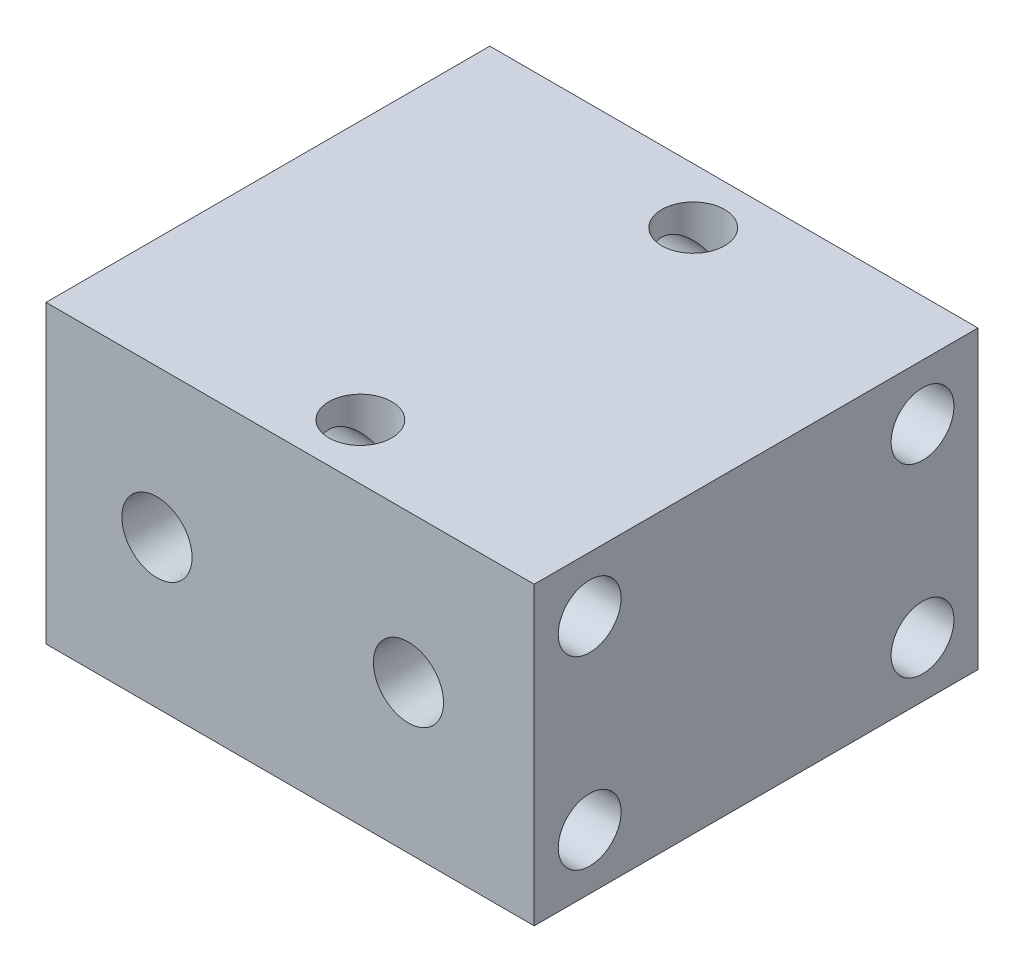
from build123d import *

# Parameters (mm, degrees)
SKETCH1_W                         = 66
SKETCH1_H                         = 60
SKETCH1_R                         = 4.25
EXTRUDE1_DEPTH                    = 40
SKETCH2_R                         = 0.5
CUT_EXTRUDE1_DEPTH                = 10
F_1_8_NPT_TAPPED_HOLE1_AT_2_COUNT = 2
F_1_8_NPT_TAPPED_HOLE1_AT_2_PITCH = 34
SKETCH5_R                         = 2
CUT_EXTRUDE2_DEPTH                = 20
CUT_EXTRUDE3_REACH                = 84.801
SKETCH6_R                         = 4.25


with BuildPart() as part:
    # Sketch1 → Extrude1 (new body)
    with BuildSketch(Plane(origin=(0, 0, 0), x_dir=(1, 0, 0), z_dir=(0, 1, 0))):
        Rectangle(SKETCH1_W, SKETCH1_H)
        with Locations(Location((2, 22.5, 0), (0, 0, 270))):
            Circle(SKETCH1_R, mode=Mode.SUBTRACT)
        with Locations(Location((2, -22.5, 0), (0, 0, 270))):
            Circle(SKETCH1_R, mode=Mode.SUBTRACT)
    extrude(amount=EXTRUDE1_DEPTH)

    # Sketch2 → Cut-Extrude1 (cut)
    with BuildSketch(Plane.ZY.offset(33)):
        with Locations((0, 20)):
            Circle(SKETCH2_R)
    extrude(amount=-CUT_EXTRUDE1_DEPTH, mode=Mode.SUBTRACT)

    # Sketch3 → 1_8 NPT Tapped Hole1 (revolve, cut)
    with BuildSketch(Plane(origin=(16, 20, 30), x_dir=(0, -1, 0), z_dir=(1, 0, 0))):
        Polygon((0, 0), (0, 14.153468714), (4.2164, 11.62), (4.2164, 6.92), (4.537398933, 6.92), (4.744593, 0), align=None)
    f_1_8_npt_tapped_hole1 = revolve(axis=Axis((16, 20, 36.35), (0, 0, -1)), mode=Mode.SUBTRACT)

    # 1_8 NPT Tapped Hole1 at 2: 1_8 NPT Tapped Hole1 ×2
    with Locations(*[(-i * F_1_8_NPT_TAPPED_HOLE1_AT_2_PITCH, 0, 0) for i in range(1, F_1_8_NPT_TAPPED_HOLE1_AT_2_COUNT)]):
        add(f_1_8_npt_tapped_hole1, mode=Mode.SUBTRACT)

    # Sketch5 → Cut-Extrude2 (cut)
    with BuildSketch(Plane.XY.offset(30)):
        with Locations((-18, 20)):
            Circle(SKETCH5_R)
        with Locations((16, 20)):
            Circle(SKETCH5_R)
    extrude(amount=-CUT_EXTRUDE2_DEPTH, mode=Mode.SUBTRACT)

    # Cut-Extrude3: up to this face of the body (flat: up to its plane)
    cut_extrude3_end = Plane(part.part.faces().sort_by_distance((33, 20, 0))[0])
    # Sketch6 → Cut-Extrude3 (cut, up to the picked face)
    with BuildSketch(Plane.ZY.offset(33), mode=Mode.PRIVATE) as cut_extrude3_sk1:
        with Locations((-22.5, 32.5)):
            Circle(SKETCH6_R)
    cut_extrude3_tool1 = split(extrude(cut_extrude3_sk1.sketch, amount=-CUT_EXTRUDE3_REACH, mode=Mode.PRIVATE), bisect_by=cut_extrude3_end, keep=Keep.BOTH, mode=Mode.PRIVATE)
    # Sketch6 → Cut-Extrude3 (cut, up to the picked face)
    with BuildSketch(Plane.ZY.offset(33), mode=Mode.PRIVATE) as cut_extrude3_sk2:
        with Locations((-22.5, 7.5)):
            Circle(SKETCH6_R)
    cut_extrude3_tool2 = split(extrude(cut_extrude3_sk2.sketch, amount=-CUT_EXTRUDE3_REACH, mode=Mode.PRIVATE), bisect_by=cut_extrude3_end, keep=Keep.BOTH, mode=Mode.PRIVATE)
    # Sketch6 → Cut-Extrude3 (cut, up to the picked face)
    with BuildSketch(Plane.ZY.offset(33), mode=Mode.PRIVATE) as cut_extrude3_sk3:
        with Locations((22.5, 32.5)):
            Circle(SKETCH6_R)
    cut_extrude3_tool3 = split(extrude(cut_extrude3_sk3.sketch, amount=-CUT_EXTRUDE3_REACH, mode=Mode.PRIVATE), bisect_by=cut_extrude3_end, keep=Keep.BOTH, mode=Mode.PRIVATE)
    # Sketch6 → Cut-Extrude3 (cut, up to the picked face)
    with BuildSketch(Plane.ZY.offset(33), mode=Mode.PRIVATE) as cut_extrude3_sk4:
        with Locations((22.5, 7.5)):
            Circle(SKETCH6_R)
    cut_extrude3_tool4 = split(extrude(cut_extrude3_sk4.sketch, amount=-CUT_EXTRUDE3_REACH, mode=Mode.PRIVATE), bisect_by=cut_extrude3_end, keep=Keep.BOTH, mode=Mode.PRIVATE)
    add(cut_extrude3_tool1.solids().sort_by(Axis((-33, 32.5, -22.5), (1, 0, 0)))[0], mode=Mode.SUBTRACT)
    add(cut_extrude3_tool2.solids().sort_by(Axis((-33, 7.5, -22.5), (1, 0, 0)))[0], mode=Mode.SUBTRACT)
    add(cut_extrude3_tool3.solids().sort_by(Axis((-33, 32.5, 22.5), (1, 0, 0)))[0], mode=Mode.SUBTRACT)
    add(cut_extrude3_tool4.solids().sort_by(Axis((-33, 7.5, 22.5), (1, 0, 0)))[0], mode=Mode.SUBTRACT)


solid = part.part
